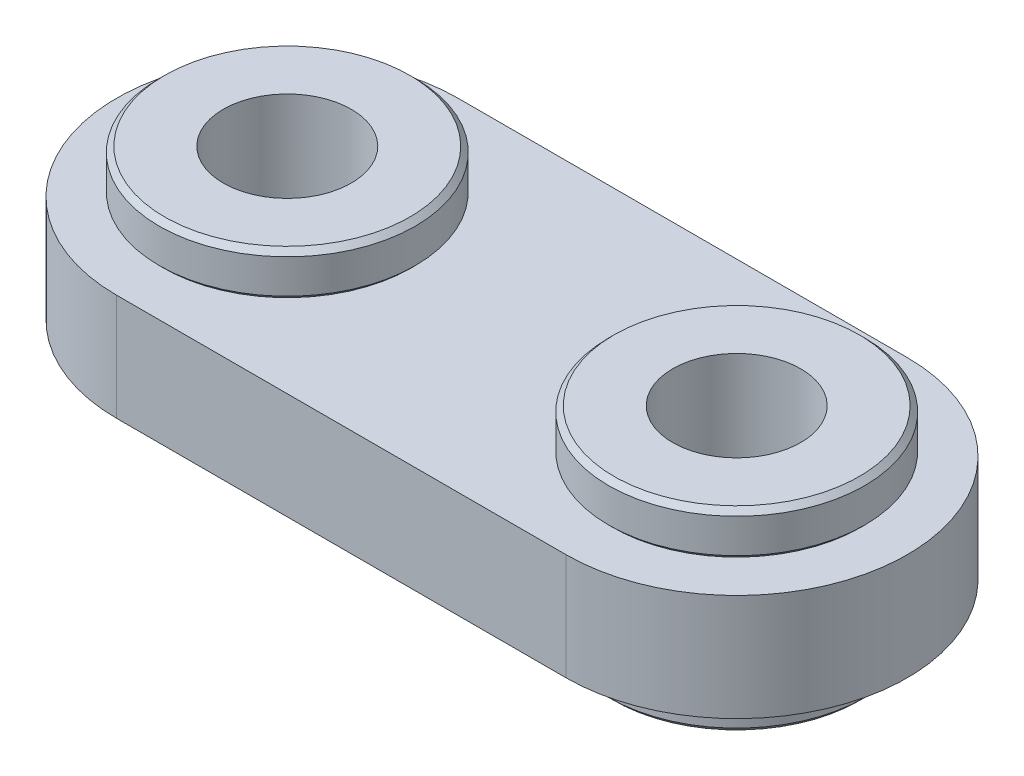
ISO-10303-21;
HEADER;
FILE_DESCRIPTION(('STEP AP214'),'2;1');
FILE_NAME('part.step','',(''),(''),'','','');
FILE_SCHEMA(('AUTOMOTIVE_DESIGN { 1 0 10303 214 1 1 1 1 }'));
ENDSEC;
DATA;
#1=APPLICATION_CONTEXT('core data for automotive mechanical design processes');
#2=APPLICATION_PROTOCOL_DEFINITION('international standard','automotive_design',2000,#1);
#3=PRODUCT_CONTEXT('',#1,'mechanical');
#4=PRODUCT('Part','Part','',(#3));
#5=PRODUCT_RELATED_PRODUCT_CATEGORY('part','',(#4));
#6=PRODUCT_DEFINITION_FORMATION('','',#4);
#7=PRODUCT_DEFINITION_CONTEXT('part definition',#1,'design');
#8=PRODUCT_DEFINITION('design','',#6,#7);
#9=PRODUCT_DEFINITION_SHAPE('','',#8);
#10=(LENGTH_UNIT() NAMED_UNIT(*) SI_UNIT(.MILLI.,.METRE.));
#11=(NAMED_UNIT(*) PLANE_ANGLE_UNIT() SI_UNIT($,.RADIAN.));
#12=(NAMED_UNIT(*) SI_UNIT($,.STERADIAN.) SOLID_ANGLE_UNIT());
#13=UNCERTAINTY_MEASURE_WITH_UNIT(LENGTH_MEASURE(1.E-05),#10,'distance_accuracy_value','');
#14=(GEOMETRIC_REPRESENTATION_CONTEXT(3) GLOBAL_UNCERTAINTY_ASSIGNED_CONTEXT((#13)) GLOBAL_UNIT_ASSIGNED_CONTEXT((#10,
#11,#12)) REPRESENTATION_CONTEXT('',''));
#15=CARTESIAN_POINT('',(0.,0.,0.));
#16=DIRECTION('',(0.,0.,1.));
#17=DIRECTION('',(1.,0.,0.));
#18=AXIS2_PLACEMENT_3D('',#15,#16,#17);
#19=CARTESIAN_POINT('',(0.,2.5,0.));
#20=DIRECTION('',(0.,1.,0.));
#21=DIRECTION('',(1.,0.,0.));
#22=AXIS2_PLACEMENT_3D('',#19,#20,#21);
#23=CYLINDRICAL_SURFACE('',#22,6.);
#24=CARTESIAN_POINT('',(0.,4.3,0.));
#25=DIRECTION('',(0.,1.,0.));
#26=DIRECTION('',(-1.,0.,0.));
#27=AXIS2_PLACEMENT_3D('',#24,#25,#26);
#28=CIRCLE('',#27,6.);
#29=CARTESIAN_POINT('',(-6.,4.3,0.));
#30=VERTEX_POINT('',#29);
#31=EDGE_CURVE('E143',#30,#30,#28,.F.);
#32=ORIENTED_EDGE('',*,*,#31,.T.);
#33=EDGE_LOOP('',(#32));
#34=FACE_BOUND('',#33,.T.);
#35=CARTESIAN_POINT('',(0.,2.7,0.));
#36=DIRECTION('',(0.,1.,0.));
#37=DIRECTION('',(1.,0.,0.));
#38=AXIS2_PLACEMENT_3D('',#35,#36,#37);
#39=CIRCLE('',#38,6.);
#40=CARTESIAN_POINT('',(6.,2.7,0.));
#41=VERTEX_POINT('',#40);
#42=EDGE_CURVE('E118',#41,#41,#39,.T.);
#43=ORIENTED_EDGE('',*,*,#42,.T.);
#44=EDGE_LOOP('',(#43));
#45=FACE_BOUND('',#44,.T.);
#46=ADVANCED_FACE('F14',(#34,#45),#23,.T.);
#47=CARTESIAN_POINT('',(0.,4.6,0.));
#48=DIRECTION('',(0.,-1.,0.));
#49=DIRECTION('',(-1.,0.,0.));
#50=AXIS2_PLACEMENT_3D('',#47,#48,#49);
#51=CYLINDRICAL_SURFACE('',#50,3.);
#52=CARTESIAN_POINT('',(0.,-4.55,0.));
#53=DIRECTION('',(0.,-1.,0.));
#54=DIRECTION('',(1.,0.,0.));
#55=AXIS2_PLACEMENT_3D('',#52,#53,#54);
#56=CIRCLE('',#55,3.);
#57=CARTESIAN_POINT('',(3.,-4.55,0.));
#58=VERTEX_POINT('',#57);
#59=EDGE_CURVE('E121',#58,#58,#56,.T.);
#60=ORIENTED_EDGE('',*,*,#59,.T.);
#61=EDGE_LOOP('',(#60));
#62=FACE_BOUND('',#61,.T.);
#63=CARTESIAN_POINT('',(0.,4.55,0.));
#64=DIRECTION('',(0.,1.,0.));
#65=DIRECTION('',(-1.,0.,0.));
#66=AXIS2_PLACEMENT_3D('',#63,#64,#65);
#67=CIRCLE('',#66,3.);
#68=CARTESIAN_POINT('',(-3.,4.55,0.));
#69=VERTEX_POINT('',#68);
#70=EDGE_CURVE('E126',#69,#69,#67,.F.);
#71=ORIENTED_EDGE('',*,*,#70,.F.);
#72=EDGE_LOOP('',(#71));
#73=FACE_BOUND('',#72,.T.);
#74=ADVANCED_FACE('F163',(#62,#73),#51,.F.);
#75=CARTESIAN_POINT('',(21.0679999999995,2.5,0.));
#76=DIRECTION('',(0.,1.,0.));
#77=DIRECTION('',(1.,0.,0.));
#78=AXIS2_PLACEMENT_3D('',#75,#76,#77);
#79=CYLINDRICAL_SURFACE('',#78,6.);
#80=CARTESIAN_POINT('',(21.0679999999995,4.3,0.));
#81=DIRECTION('',(0.,1.,0.));
#82=DIRECTION('',(-1.,0.,0.));
#83=AXIS2_PLACEMENT_3D('',#80,#81,#82);
#84=CIRCLE('',#83,6.);
#85=CARTESIAN_POINT('',(15.0679999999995,4.3,0.));
#86=VERTEX_POINT('',#85);
#87=EDGE_CURVE('E9',#86,#86,#84,.F.);
#88=ORIENTED_EDGE('',*,*,#87,.T.);
#89=EDGE_LOOP('',(#88));
#90=FACE_BOUND('',#89,.T.);
#91=CARTESIAN_POINT('',(21.0679999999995,2.7,0.));
#92=DIRECTION('',(0.,1.,0.));
#93=DIRECTION('',(1.,0.,0.));
#94=AXIS2_PLACEMENT_3D('',#91,#92,#93);
#95=CIRCLE('',#94,6.);
#96=CARTESIAN_POINT('',(27.0679999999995,2.7,0.));
#97=VERTEX_POINT('',#96);
#98=EDGE_CURVE('E111',#97,#97,#95,.T.);
#99=ORIENTED_EDGE('',*,*,#98,.T.);
#100=EDGE_LOOP('',(#99));
#101=FACE_BOUND('',#100,.T.);
#102=ADVANCED_FACE('F170',(#90,#101),#79,.T.);
#103=CARTESIAN_POINT('',(21.0679999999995,4.6,0.));
#104=DIRECTION('',(0.,-1.,0.));
#105=DIRECTION('',(-1.,0.,0.));
#106=AXIS2_PLACEMENT_3D('',#103,#104,#105);
#107=CYLINDRICAL_SURFACE('',#106,3.);
#108=CARTESIAN_POINT('',(21.0679999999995,-4.55,0.));
#109=DIRECTION('',(0.,-1.,0.));
#110=DIRECTION('',(1.,0.,0.));
#111=AXIS2_PLACEMENT_3D('',#108,#109,#110);
#112=CIRCLE('',#111,3.);
#113=CARTESIAN_POINT('',(24.0679999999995,-4.55,0.));
#114=VERTEX_POINT('',#113);
#115=EDGE_CURVE('E125',#114,#114,#112,.T.);
#116=ORIENTED_EDGE('',*,*,#115,.T.);
#117=EDGE_LOOP('',(#116));
#118=FACE_BOUND('',#117,.T.);
#119=CARTESIAN_POINT('',(21.0679999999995,4.55,0.));
#120=DIRECTION('',(0.,1.,0.));
#121=DIRECTION('',(-1.,0.,0.));
#122=AXIS2_PLACEMENT_3D('',#119,#120,#121);
#123=CIRCLE('',#122,3.);
#124=CARTESIAN_POINT('',(18.0679999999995,4.55,0.));
#125=VERTEX_POINT('',#124);
#126=EDGE_CURVE('E122',#125,#125,#123,.F.);
#127=ORIENTED_EDGE('',*,*,#126,.F.);
#128=EDGE_LOOP('',(#127));
#129=FACE_BOUND('',#128,.T.);
#130=ADVANCED_FACE('F220',(#118,#129),#107,.F.);
#131=CARTESIAN_POINT('',(0.,2.5,0.));
#132=DIRECTION('',(0.,-1.,0.));
#133=DIRECTION('',(1.,0.,0.));
#134=AXIS2_PLACEMENT_3D('',#131,#132,#133);
#135=PLANE('',#134);
#136=CARTESIAN_POINT('',(0.,2.5,0.));
#137=DIRECTION('',(0.,-1.,0.));
#138=DIRECTION('',(1.,0.,0.));
#139=AXIS2_PLACEMENT_3D('',#136,#137,#138);
#140=CIRCLE('',#139,5.8);
#141=CARTESIAN_POINT('',(5.8,2.5,0.));
#142=VERTEX_POINT('',#141);
#143=EDGE_CURVE('E108',#142,#142,#140,.F.);
#144=ORIENTED_EDGE('',*,*,#143,.F.);
#145=EDGE_LOOP('',(#144));
#146=FACE_BOUND('',#145,.T.);
#147=DIRECTION('',(-1.,0.,0.));
#148=VECTOR('',#147,1.);
#149=CARTESIAN_POINT('',(21.068,2.5,8.));
#150=LINE('',#149,#148);
#151=CARTESIAN_POINT('',(21.068,2.5,8.));
#152=VERTEX_POINT('',#151);
#153=CARTESIAN_POINT('',(0.,2.5,8.));
#154=VERTEX_POINT('',#153);
#155=EDGE_CURVE('E102',#152,#154,#150,.T.);
#156=ORIENTED_EDGE('',*,*,#155,.F.);
#157=CARTESIAN_POINT('',(21.068,2.5,0.));
#158=DIRECTION('',(0.,-1.,0.));
#159=DIRECTION('',(-1.,0.,0.));
#160=AXIS2_PLACEMENT_3D('',#157,#158,#159);
#161=CIRCLE('',#160,8.);
#162=CARTESIAN_POINT('',(21.068,2.5,-8.));
#163=VERTEX_POINT('',#162);
#164=EDGE_CURVE('E105',#163,#152,#161,.T.);
#165=ORIENTED_EDGE('',*,*,#164,.F.);
#166=DIRECTION('',(1.,0.,0.));
#167=VECTOR('',#166,1.);
#168=CARTESIAN_POINT('',(0.,2.5,-8.));
#169=LINE('',#168,#167);
#170=CARTESIAN_POINT('',(0.,2.5,-8.));
#171=VERTEX_POINT('',#170);
#172=EDGE_CURVE('E101',#171,#163,#169,.T.);
#173=ORIENTED_EDGE('',*,*,#172,.F.);
#174=CARTESIAN_POINT('',(0.,2.5,0.));
#175=DIRECTION('',(0.,-1.,0.));
#176=DIRECTION('',(1.,0.,0.));
#177=AXIS2_PLACEMENT_3D('',#174,#175,#176);
#178=CIRCLE('',#177,8.);
#179=EDGE_CURVE('E71',#154,#171,#178,.T.);
#180=ORIENTED_EDGE('',*,*,#179,.F.);
#181=EDGE_LOOP('',(#156,#165,#173,#180));
#182=FACE_BOUND('',#181,.T.);
#183=CARTESIAN_POINT('',(21.0679999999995,2.5,0.));
#184=DIRECTION('',(0.,-1.,0.));
#185=DIRECTION('',(1.,0.,0.));
#186=AXIS2_PLACEMENT_3D('',#183,#184,#185);
#187=CIRCLE('',#186,5.8);
#188=CARTESIAN_POINT('',(26.8679999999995,2.5,0.));
#189=VERTEX_POINT('',#188);
#190=EDGE_CURVE('E96',#189,#189,#187,.F.);
#191=ORIENTED_EDGE('',*,*,#190,.F.);
#192=EDGE_LOOP('',(#191));
#193=FACE_BOUND('',#192,.T.);
#194=ADVANCED_FACE('F181',(#146,#182,#193),#135,.F.);
#195=CARTESIAN_POINT('',(0.,2.5,0.));
#196=DIRECTION('',(0.,1.,0.));
#197=DIRECTION('',(1.,0.,0.));
#198=AXIS2_PLACEMENT_3D('',#195,#196,#197);
#199=CONICAL_SURFACE('',#198,5.8,0.785398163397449);
#200=ORIENTED_EDGE('',*,*,#42,.F.);
#201=EDGE_LOOP('',(#200));
#202=FACE_BOUND('',#201,.T.);
#203=ORIENTED_EDGE('',*,*,#143,.T.);
#204=EDGE_LOOP('',(#203));
#205=FACE_BOUND('',#204,.T.);
#206=ADVANCED_FACE('F178',(#202,#205),#199,.T.);
#207=CARTESIAN_POINT('',(21.0679999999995,2.5,0.));
#208=DIRECTION('',(0.,1.,0.));
#209=DIRECTION('',(1.,0.,0.));
#210=AXIS2_PLACEMENT_3D('',#207,#208,#209);
#211=CONICAL_SURFACE('',#210,5.8,0.785398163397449);
#212=ORIENTED_EDGE('',*,*,#98,.F.);
#213=EDGE_LOOP('',(#212));
#214=FACE_BOUND('',#213,.T.);
#215=ORIENTED_EDGE('',*,*,#190,.T.);
#216=EDGE_LOOP('',(#215));
#217=FACE_BOUND('',#216,.T.);
#218=ADVANCED_FACE('F176',(#214,#217),#211,.T.);
#219=CARTESIAN_POINT('',(0.,-2.5,0.));
#220=DIRECTION('',(0.,-1.,0.));
#221=DIRECTION('',(-1.,0.,0.));
#222=AXIS2_PLACEMENT_3D('',#219,#220,#221);
#223=CONICAL_SURFACE('',#222,5.75,0.785398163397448);
#224=CARTESIAN_POINT('',(0.,-2.75,0.));
#225=DIRECTION('',(0.,-1.,0.));
#226=DIRECTION('',(-1.,0.,0.));
#227=AXIS2_PLACEMENT_3D('',#224,#225,#226);
#228=CIRCLE('',#227,6.);
#229=CARTESIAN_POINT('',(-6.,-2.75,0.));
#230=VERTEX_POINT('',#229);
#231=EDGE_CURVE('E82',#230,#230,#228,.T.);
#232=ORIENTED_EDGE('',*,*,#231,.F.);
#233=EDGE_LOOP('',(#232));
#234=FACE_BOUND('',#233,.T.);
#235=CARTESIAN_POINT('',(0.,-2.5,0.));
#236=DIRECTION('',(0.,-1.,0.));
#237=DIRECTION('',(-1.,0.,0.));
#238=AXIS2_PLACEMENT_3D('',#235,#236,#237);
#239=CIRCLE('',#238,5.75);
#240=CARTESIAN_POINT('',(-5.75,-2.5,0.));
#241=VERTEX_POINT('',#240);
#242=EDGE_CURVE('E90',#241,#241,#239,.T.);
#243=ORIENTED_EDGE('',*,*,#242,.T.);
#244=EDGE_LOOP('',(#243));
#245=FACE_BOUND('',#244,.T.);
#246=ADVANCED_FACE('F223',(#234,#245),#223,.T.);
#247=CARTESIAN_POINT('',(0.,4.6,0.));
#248=DIRECTION('',(0.,-1.,0.));
#249=DIRECTION('',(-1.,0.,0.));
#250=AXIS2_PLACEMENT_3D('',#247,#248,#249);
#251=CYLINDRICAL_SURFACE('',#250,6.);
#252=CARTESIAN_POINT('',(0.,-4.3,0.));
#253=DIRECTION('',(0.,-1.,0.));
#254=DIRECTION('',(1.,0.,0.));
#255=AXIS2_PLACEMENT_3D('',#252,#253,#254);
#256=CIRCLE('',#255,6.);
#257=CARTESIAN_POINT('',(6.,-4.3,0.));
#258=VERTEX_POINT('',#257);
#259=EDGE_CURVE('E131',#258,#258,#256,.F.);
#260=ORIENTED_EDGE('',*,*,#259,.T.);
#261=EDGE_LOOP('',(#260));
#262=FACE_BOUND('',#261,.T.);
#263=ORIENTED_EDGE('',*,*,#231,.T.);
#264=EDGE_LOOP('',(#263));
#265=FACE_BOUND('',#264,.T.);
#266=ADVANCED_FACE('F214',(#262,#265),#251,.T.);
#267=CARTESIAN_POINT('',(21.0679999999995,-2.5,0.));
#268=DIRECTION('',(0.,-1.,0.));
#269=DIRECTION('',(-1.,0.,0.));
#270=AXIS2_PLACEMENT_3D('',#267,#268,#269);
#271=CONICAL_SURFACE('',#270,5.75,0.785398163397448);
#272=CARTESIAN_POINT('',(21.0679999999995,-2.75,0.));
#273=DIRECTION('',(0.,-1.,0.));
#274=DIRECTION('',(-1.,0.,0.));
#275=AXIS2_PLACEMENT_3D('',#272,#273,#274);
#276=CIRCLE('',#275,6.);
#277=CARTESIAN_POINT('',(15.0679999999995,-2.75,0.));
#278=VERTEX_POINT('',#277);
#279=EDGE_CURVE('E89',#278,#278,#276,.T.);
#280=ORIENTED_EDGE('',*,*,#279,.F.);
#281=EDGE_LOOP('',(#280));
#282=FACE_BOUND('',#281,.T.);
#283=CARTESIAN_POINT('',(21.0679999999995,-2.5,0.));
#284=DIRECTION('',(0.,-1.,0.));
#285=DIRECTION('',(-1.,0.,0.));
#286=AXIS2_PLACEMENT_3D('',#283,#284,#285);
#287=CIRCLE('',#286,5.75);
#288=CARTESIAN_POINT('',(15.3179999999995,-2.5,0.));
#289=VERTEX_POINT('',#288);
#290=EDGE_CURVE('E86',#289,#289,#287,.T.);
#291=ORIENTED_EDGE('',*,*,#290,.T.);
#292=EDGE_LOOP('',(#291));
#293=FACE_BOUND('',#292,.T.);
#294=ADVANCED_FACE('F183',(#282,#293),#271,.T.);
#295=CARTESIAN_POINT('',(21.0679999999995,4.6,0.));
#296=DIRECTION('',(0.,-1.,0.));
#297=DIRECTION('',(-1.,0.,0.));
#298=AXIS2_PLACEMENT_3D('',#295,#296,#297);
#299=CYLINDRICAL_SURFACE('',#298,6.);
#300=CARTESIAN_POINT('',(21.0679999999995,-4.3,0.));
#301=DIRECTION('',(0.,-1.,0.));
#302=DIRECTION('',(1.,0.,0.));
#303=AXIS2_PLACEMENT_3D('',#300,#301,#302);
#304=CIRCLE('',#303,6.);
#305=CARTESIAN_POINT('',(27.0679999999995,-4.3,0.));
#306=VERTEX_POINT('',#305);
#307=EDGE_CURVE('E137',#306,#306,#304,.F.);
#308=ORIENTED_EDGE('',*,*,#307,.T.);
#309=EDGE_LOOP('',(#308));
#310=FACE_BOUND('',#309,.T.);
#311=ORIENTED_EDGE('',*,*,#279,.T.);
#312=EDGE_LOOP('',(#311));
#313=FACE_BOUND('',#312,.T.);
#314=ADVANCED_FACE('F231',(#310,#313),#299,.T.);
#315=CARTESIAN_POINT('',(21.068,-2.5,0.));
#316=DIRECTION('',(0.,1.,0.));
#317=DIRECTION('',(-1.,0.,0.));
#318=AXIS2_PLACEMENT_3D('',#315,#316,#317);
#319=CYLINDRICAL_SURFACE('',#318,8.);
#320=DIRECTION('',(0.,1.,0.));
#321=VECTOR('',#320,1.);
#322=CARTESIAN_POINT('',(21.068,-2.5,-8.));
#323=LINE('',#322,#321);
#324=CARTESIAN_POINT('',(21.068,-2.5,-8.));
#325=VERTEX_POINT('',#324);
#326=EDGE_CURVE('E47',#325,#163,#323,.T.);
#327=ORIENTED_EDGE('',*,*,#326,.T.);
#328=ORIENTED_EDGE('',*,*,#164,.T.);
#329=DIRECTION('',(0.,1.,0.));
#330=VECTOR('',#329,1.);
#331=CARTESIAN_POINT('',(21.068,-2.5,8.));
#332=LINE('',#331,#330);
#333=CARTESIAN_POINT('',(21.068,-2.5,8.));
#334=VERTEX_POINT('',#333);
#335=EDGE_CURVE('E54',#334,#152,#332,.T.);
#336=ORIENTED_EDGE('',*,*,#335,.F.);
#337=CARTESIAN_POINT('',(21.068,-2.5,0.));
#338=DIRECTION('',(0.,-1.,0.));
#339=DIRECTION('',(-1.,0.,0.));
#340=AXIS2_PLACEMENT_3D('',#337,#338,#339);
#341=CIRCLE('',#340,8.);
#342=EDGE_CURVE('E31',#325,#334,#341,.T.);
#343=ORIENTED_EDGE('',*,*,#342,.F.);
#344=EDGE_LOOP('',(#327,#328,#336,#343));
#345=FACE_BOUND('',#344,.T.);
#346=ADVANCED_FACE('F241',(#345),#319,.T.);
#347=CARTESIAN_POINT('',(21.068,-2.5,8.));
#348=DIRECTION('',(0.,0.,-1.));
#349=DIRECTION('',(0.,1.,0.));
#350=AXIS2_PLACEMENT_3D('',#347,#348,#349);
#351=PLANE('',#350);
#352=ORIENTED_EDGE('',*,*,#335,.T.);
#353=ORIENTED_EDGE('',*,*,#155,.T.);
#354=DIRECTION('',(0.,1.,0.));
#355=VECTOR('',#354,1.);
#356=CARTESIAN_POINT('',(0.,-2.5,8.));
#357=LINE('',#356,#355);
#358=CARTESIAN_POINT('',(0.,-2.5,8.));
#359=VERTEX_POINT('',#358);
#360=EDGE_CURVE('E74',#359,#154,#357,.T.);
#361=ORIENTED_EDGE('',*,*,#360,.F.);
#362=DIRECTION('',(-1.,0.,0.));
#363=VECTOR('',#362,1.);
#364=CARTESIAN_POINT('',(21.068,-2.5,8.));
#365=LINE('',#364,#363);
#366=EDGE_CURVE('E64',#334,#359,#365,.T.);
#367=ORIENTED_EDGE('',*,*,#366,.F.);
#368=EDGE_LOOP('',(#352,#353,#361,#367));
#369=FACE_BOUND('',#368,.T.);
#370=ADVANCED_FACE('F238',(#369),#351,.F.);
#371=CARTESIAN_POINT('',(0.,-2.5,0.));
#372=DIRECTION('',(0.,-1.,0.));
#373=DIRECTION('',(1.,0.,0.));
#374=AXIS2_PLACEMENT_3D('',#371,#372,#373);
#375=PLANE('',#374);
#376=ORIENTED_EDGE('',*,*,#242,.F.);
#377=EDGE_LOOP('',(#376));
#378=FACE_BOUND('',#377,.T.);
#379=ORIENTED_EDGE('',*,*,#290,.F.);
#380=EDGE_LOOP('',(#379));
#381=FACE_BOUND('',#380,.T.);
#382=ORIENTED_EDGE('',*,*,#366,.T.);
#383=CARTESIAN_POINT('',(0.,-2.5,0.));
#384=DIRECTION('',(0.,-1.,0.));
#385=DIRECTION('',(1.,0.,0.));
#386=AXIS2_PLACEMENT_3D('',#383,#384,#385);
#387=CIRCLE('',#386,8.);
#388=CARTESIAN_POINT('',(0.,-2.5,-8.));
#389=VERTEX_POINT('',#388);
#390=EDGE_CURVE('E60',#359,#389,#387,.T.);
#391=ORIENTED_EDGE('',*,*,#390,.T.);
#392=DIRECTION('',(1.,0.,0.));
#393=VECTOR('',#392,1.);
#394=CARTESIAN_POINT('',(0.,-2.5,-8.));
#395=LINE('',#394,#393);
#396=EDGE_CURVE('E63',#389,#325,#395,.T.);
#397=ORIENTED_EDGE('',*,*,#396,.T.);
#398=ORIENTED_EDGE('',*,*,#342,.T.);
#399=EDGE_LOOP('',(#382,#391,#397,#398));
#400=FACE_BOUND('',#399,.T.);
#401=ADVANCED_FACE('F61',(#378,#381,#400),#375,.T.);
#402=CARTESIAN_POINT('',(0.,-2.5,-8.));
#403=DIRECTION('',(0.,0.,1.));
#404=DIRECTION('',(0.,-1.,0.));
#405=AXIS2_PLACEMENT_3D('',#402,#403,#404);
#406=PLANE('',#405);
#407=DIRECTION('',(0.,1.,0.));
#408=VECTOR('',#407,1.);
#409=CARTESIAN_POINT('',(0.,-2.5,-8.));
#410=LINE('',#409,#408);
#411=EDGE_CURVE('E68',#389,#171,#410,.T.);
#412=ORIENTED_EDGE('',*,*,#411,.T.);
#413=ORIENTED_EDGE('',*,*,#172,.T.);
#414=ORIENTED_EDGE('',*,*,#326,.F.);
#415=ORIENTED_EDGE('',*,*,#396,.F.);
#416=EDGE_LOOP('',(#412,#413,#414,#415));
#417=FACE_BOUND('',#416,.T.);
#418=ADVANCED_FACE('F76',(#417),#406,.F.);
#419=CARTESIAN_POINT('',(0.,-2.5,0.));
#420=DIRECTION('',(0.,1.,0.));
#421=DIRECTION('',(-1.,0.,0.));
#422=AXIS2_PLACEMENT_3D('',#419,#420,#421);
#423=CYLINDRICAL_SURFACE('',#422,8.);
#424=ORIENTED_EDGE('',*,*,#360,.T.);
#425=ORIENTED_EDGE('',*,*,#179,.T.);
#426=ORIENTED_EDGE('',*,*,#411,.F.);
#427=ORIENTED_EDGE('',*,*,#390,.F.);
#428=EDGE_LOOP('',(#424,#425,#426,#427));
#429=FACE_BOUND('',#428,.T.);
#430=ADVANCED_FACE('F69',(#429),#423,.T.);
#431=CARTESIAN_POINT('',(0.,-4.55,0.));
#432=DIRECTION('',(0.,-1.,0.));
#433=DIRECTION('',(1.,0.,0.));
#434=AXIS2_PLACEMENT_3D('',#431,#432,#433);
#435=PLANE('',#434);
#436=CARTESIAN_POINT('',(0.,-4.55,0.));
#437=DIRECTION('',(0.,-1.,0.));
#438=DIRECTION('',(1.,0.,0.));
#439=AXIS2_PLACEMENT_3D('',#436,#437,#438);
#440=CIRCLE('',#439,5.75);
#441=CARTESIAN_POINT('',(5.75,-4.55,0.));
#442=VERTEX_POINT('',#441);
#443=EDGE_CURVE('E93',#442,#442,#440,.T.);
#444=ORIENTED_EDGE('',*,*,#443,.T.);
#445=EDGE_LOOP('',(#444));
#446=FACE_BOUND('',#445,.T.);
#447=ORIENTED_EDGE('',*,*,#59,.F.);
#448=EDGE_LOOP('',(#447));
#449=FACE_BOUND('',#448,.T.);
#450=ADVANCED_FACE('F201',(#446,#449),#435,.T.);
#451=CARTESIAN_POINT('',(21.0679999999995,-4.55,0.));
#452=DIRECTION('',(0.,-1.,0.));
#453=DIRECTION('',(1.,0.,0.));
#454=AXIS2_PLACEMENT_3D('',#451,#452,#453);
#455=PLANE('',#454);
#456=CARTESIAN_POINT('',(21.0679999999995,-4.55,0.));
#457=DIRECTION('',(0.,-1.,0.));
#458=DIRECTION('',(1.,0.,0.));
#459=AXIS2_PLACEMENT_3D('',#456,#457,#458);
#460=CIRCLE('',#459,5.75);
#461=CARTESIAN_POINT('',(26.8179999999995,-4.55,0.));
#462=VERTEX_POINT('',#461);
#463=EDGE_CURVE('E134',#462,#462,#460,.T.);
#464=ORIENTED_EDGE('',*,*,#463,.T.);
#465=EDGE_LOOP('',(#464));
#466=FACE_BOUND('',#465,.T.);
#467=ORIENTED_EDGE('',*,*,#115,.F.);
#468=EDGE_LOOP('',(#467));
#469=FACE_BOUND('',#468,.T.);
#470=ADVANCED_FACE('F198',(#466,#469),#455,.T.);
#471=CARTESIAN_POINT('',(21.0679999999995,4.55,0.));
#472=DIRECTION('',(0.,1.,0.));
#473=DIRECTION('',(-1.,0.,0.));
#474=AXIS2_PLACEMENT_3D('',#471,#472,#473);
#475=PLANE('',#474);
#476=CARTESIAN_POINT('',(21.0679999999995,4.55,0.));
#477=DIRECTION('',(0.,1.,0.));
#478=DIRECTION('',(-1.,0.,0.));
#479=AXIS2_PLACEMENT_3D('',#476,#477,#478);
#480=CIRCLE('',#479,5.75);
#481=CARTESIAN_POINT('',(15.3179999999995,4.55,0.));
#482=VERTEX_POINT('',#481);
#483=EDGE_CURVE('E23',#482,#482,#480,.T.);
#484=ORIENTED_EDGE('',*,*,#483,.T.);
#485=EDGE_LOOP('',(#484));
#486=FACE_BOUND('',#485,.T.);
#487=ORIENTED_EDGE('',*,*,#126,.T.);
#488=EDGE_LOOP('',(#487));
#489=FACE_BOUND('',#488,.T.);
#490=ADVANCED_FACE('F148',(#486,#489),#475,.T.);
#491=CARTESIAN_POINT('',(0.,4.55,0.));
#492=DIRECTION('',(0.,1.,0.));
#493=DIRECTION('',(-1.,0.,0.));
#494=AXIS2_PLACEMENT_3D('',#491,#492,#493);
#495=PLANE('',#494);
#496=CARTESIAN_POINT('',(0.,4.55,0.));
#497=DIRECTION('',(0.,1.,0.));
#498=DIRECTION('',(-1.,0.,0.));
#499=AXIS2_PLACEMENT_3D('',#496,#497,#498);
#500=CIRCLE('',#499,5.75);
#501=CARTESIAN_POINT('',(-5.75,4.55,0.));
#502=VERTEX_POINT('',#501);
#503=EDGE_CURVE('E140',#502,#502,#500,.T.);
#504=ORIENTED_EDGE('',*,*,#503,.T.);
#505=EDGE_LOOP('',(#504));
#506=FACE_BOUND('',#505,.T.);
#507=ORIENTED_EDGE('',*,*,#70,.T.);
#508=EDGE_LOOP('',(#507));
#509=FACE_BOUND('',#508,.T.);
#510=ADVANCED_FACE('F187',(#506,#509),#495,.T.);
#511=CARTESIAN_POINT('',(0.,-4.55,0.));
#512=DIRECTION('',(0.,1.,0.));
#513=DIRECTION('',(-1.,0.,0.));
#514=AXIS2_PLACEMENT_3D('',#511,#512,#513);
#515=CONICAL_SURFACE('',#514,5.75,0.785398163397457);
#516=ORIENTED_EDGE('',*,*,#259,.F.);
#517=EDGE_LOOP('',(#516));
#518=FACE_BOUND('',#517,.T.);
#519=ORIENTED_EDGE('',*,*,#443,.F.);
#520=EDGE_LOOP('',(#519));
#521=FACE_BOUND('',#520,.T.);
#522=ADVANCED_FACE('F184',(#518,#521),#515,.T.);
#523=CARTESIAN_POINT('',(21.0679999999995,-4.55,0.));
#524=DIRECTION('',(0.,1.,0.));
#525=DIRECTION('',(-1.,0.,0.));
#526=AXIS2_PLACEMENT_3D('',#523,#524,#525);
#527=CONICAL_SURFACE('',#526,5.75,0.785398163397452);
#528=ORIENTED_EDGE('',*,*,#307,.F.);
#529=EDGE_LOOP('',(#528));
#530=FACE_BOUND('',#529,.T.);
#531=ORIENTED_EDGE('',*,*,#463,.F.);
#532=EDGE_LOOP('',(#531));
#533=FACE_BOUND('',#532,.T.);
#534=ADVANCED_FACE('F159',(#530,#533),#527,.T.);
#535=CARTESIAN_POINT('',(0.,4.55,0.));
#536=DIRECTION('',(0.,-1.,0.));
#537=DIRECTION('',(1.,0.,0.));
#538=AXIS2_PLACEMENT_3D('',#535,#536,#537);
#539=CONICAL_SURFACE('',#538,5.75,0.785398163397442);
#540=ORIENTED_EDGE('',*,*,#31,.F.);
#541=EDGE_LOOP('',(#540));
#542=FACE_BOUND('',#541,.T.);
#543=ORIENTED_EDGE('',*,*,#503,.F.);
#544=EDGE_LOOP('',(#543));
#545=FACE_BOUND('',#544,.T.);
#546=ADVANCED_FACE('F152',(#542,#545),#539,.T.);
#547=CARTESIAN_POINT('',(21.0679999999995,4.55,0.));
#548=DIRECTION('',(0.,-1.,0.));
#549=DIRECTION('',(1.,0.,0.));
#550=AXIS2_PLACEMENT_3D('',#547,#548,#549);
#551=CONICAL_SURFACE('',#550,5.75,0.785398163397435);
#552=ORIENTED_EDGE('',*,*,#87,.F.);
#553=EDGE_LOOP('',(#552));
#554=FACE_BOUND('',#553,.T.);
#555=ORIENTED_EDGE('',*,*,#483,.F.);
#556=EDGE_LOOP('',(#555));
#557=FACE_BOUND('',#556,.T.);
#558=ADVANCED_FACE('F16',(#554,#557),#551,.T.);
#559=CLOSED_SHELL('',(#46,#74,#102,#130,#194,#206,#218,#246,#266,#294,#314,#346,#370,#401,#418,
#430,#450,#470,#490,#510,#522,#534,#546,#558));
#560=MANIFOLD_SOLID_BREP('B1',#559);
#561=ADVANCED_BREP_SHAPE_REPRESENTATION('',(#18,#560),#14);
#562=SHAPE_DEFINITION_REPRESENTATION(#9,#561);
ENDSEC;
END-ISO-10303-21;
